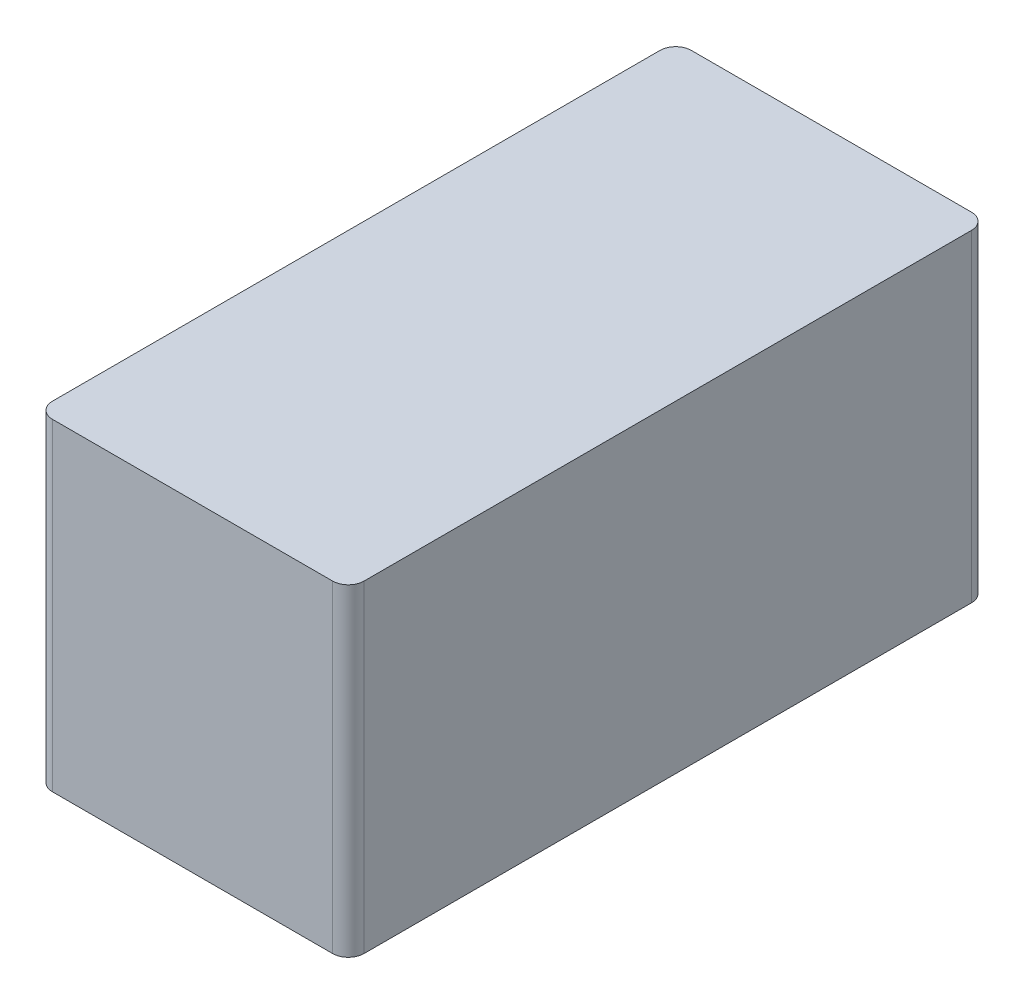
from build123d import *

# Parameters (mm, degrees)
SKETCH1_W           = 19.8
SKETCH1_H           = 40.6
BOSS_EXTRUDE1_DEPTH = 10.25
FILLET1_R           = 1


with BuildPart() as part:
    # Sketch1 → Boss-Extrude1 (new, symmetric)
    with BuildSketch(Plane(origin=(0, 0, 0), x_dir=(1, 0, 0), z_dir=(0, 1, 0))):
        Rectangle(SKETCH1_W, SKETCH1_H)
    extrude(amount=BOSS_EXTRUDE1_DEPTH, both=True)

    # Fillet1
    fillet1_edges = [part.edges().sort_by_distance(p)[0] for p in [
        (9.9, 0, 20.3),
        (-9.9, 0, 20.3),
        (-9.9, 0, -20.3),
        (9.9, 0, -20.3),
    ]]
    fillet(fillet1_edges, radius=FILLET1_R)


solid = part.part
